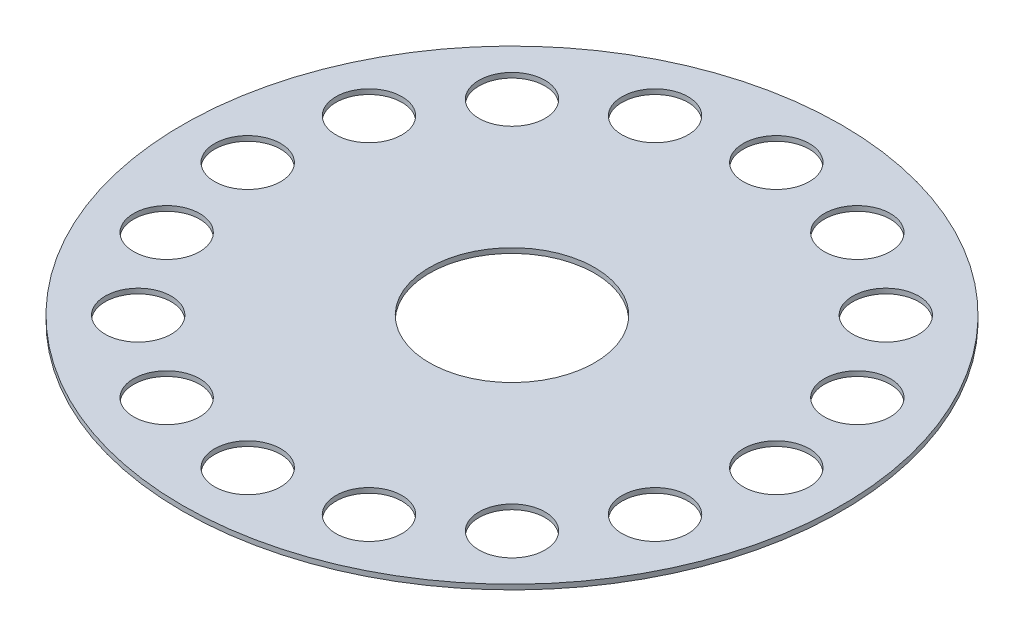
from build123d import *

# Parameters (mm, degrees)
SKETCH1_R           = 99.75
BOSS_EXTRUDE1_DEPTH = 1.5
SKETCH2_R           = 10
CUT_EXTRUDE1_DEPTH  = 142.07577751
CIRPATTERN1_COUNT   = 16
SKETCH4_R           = 25
CUT_EXTRUDE3_DEPTH  = 142.07577751


with BuildPart() as part:
    # Sketch1 → Boss-Extrude1 (new body)
    with BuildSketch(Plane(origin=(0, 0, 0), x_dir=(1, 0, 0), z_dir=(0, 1, 0))):
        with Locations(Location((0, 0, 0), (0, 0, 270))):
            Circle(SKETCH1_R)
    extrude(amount=BOSS_EXTRUDE1_DEPTH)

    # Sketch2 → Cut-Extrude1 (cut, through all)
    with BuildSketch(Plane(origin=(0, 1.5, 0), x_dir=(1, 0, 0), z_dir=(0, 1, 0))):
        with Locations(Location((0, 80, 0), (0, 0, 270))):
            Circle(SKETCH2_R)
    cut_extrude1 = extrude(amount=-CUT_EXTRUDE1_DEPTH, mode=Mode.SUBTRACT)

    # CirPattern1: Cut-Extrude1 ×16 about axis
    cirpattern1_axis = Axis((0, 0, 0), (0, 1, 0))
    for i in range(1, CIRPATTERN1_COUNT):
        add(cut_extrude1.rotate(cirpattern1_axis, i * 360 / CIRPATTERN1_COUNT), mode=Mode.SUBTRACT)

    # Sketch4 → Cut-Extrude3 (cut, through all)
    with BuildSketch(Plane(origin=(0, 0, 0), x_dir=(-1, 0, 0), z_dir=(0, -1, 0))):
        with Locations(Location((0, 0, 0), (0, 0, 90))):
            Circle(SKETCH4_R)
    extrude(amount=-CUT_EXTRUDE3_DEPTH, mode=Mode.SUBTRACT)


solid = part.part
